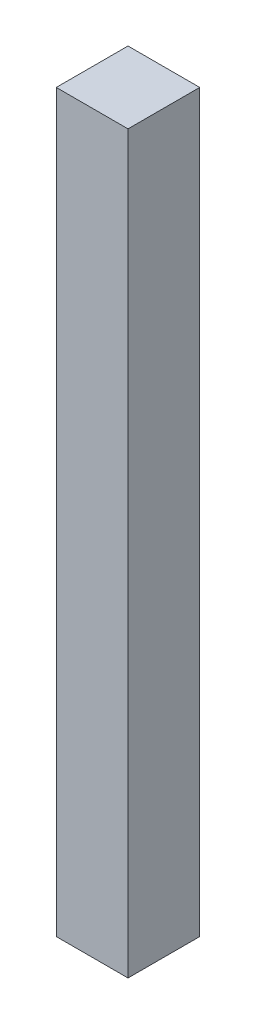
from build123d import *

# Parameters (mm, degrees)
ESQUISSE1_W        = 40
ESQUISSE1_H        = 410
BOSS_EXTRU_1_DEPTH = 40


with BuildPart() as part:
    # Esquisse1 → Boss.-Extru.1 (new body)
    with BuildSketch(Plane.XY):
        with Locations((430, 205)):
            Rectangle(ESQUISSE1_W, ESQUISSE1_H)
    extrude(amount=-BOSS_EXTRU_1_DEPTH)


solid = part.part
